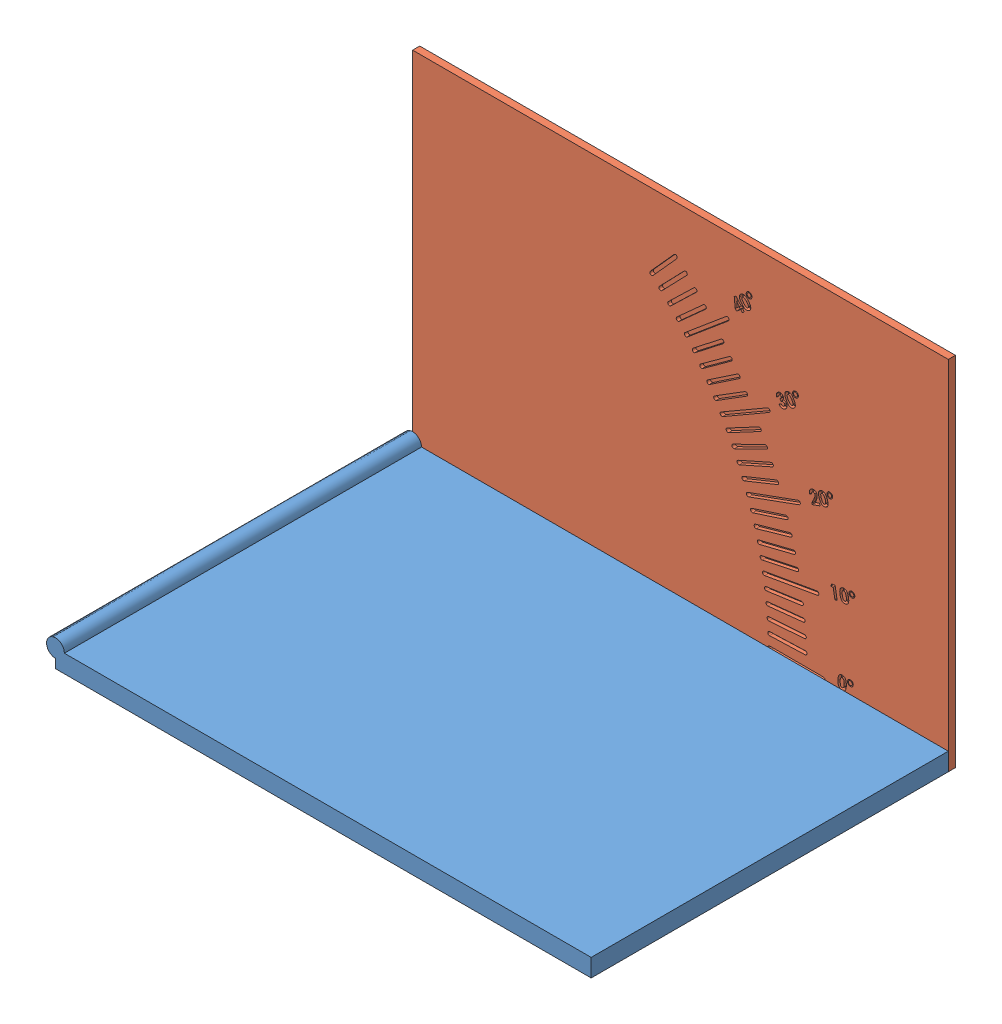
SolidWorks assembly SE Support.SLDASM, configuration Défaut (file format 9000). Lengths in mm.
Overall size (152.5 100 102).
2 component instances, 2 part files, 3 mates.
Components (placement in the parent):
- Plaque fixe-1: Plaque fixe.SLDPRT [Défaut] at (-73.3328 -10.641 0) size (152.5 7.5 100)
- Graduation-1: Graduation.SLDPRT [Défaut] at (-73.3328 -10.641 -50) size (150 100 2)
Mates (geometry in assembly coordinates):
- Coïncidente1: coincident: plane of Plaque fixe-1 through (-73.3328 -15.641 -50) normal (0 0 -1); plane of Graduation-1 through (-73.3328 -15.641 -50) normal (0 0 1)
- Coïncidente2: coincident: plane of Plaque fixe-1 through (76.6672 -10.641 50) normal (1 0 0); plane of Graduation-1 through (76.6672 84.359 -52) normal (1 0 0)
- Coïncidente3: coincident aligned: plane of Plaque fixe-1 through (-73.3328 -15.641 50) normal (0 -1 0); plane of Graduation-1 through (-73.3328 -15.641 -52) normal (0 -1 0)
